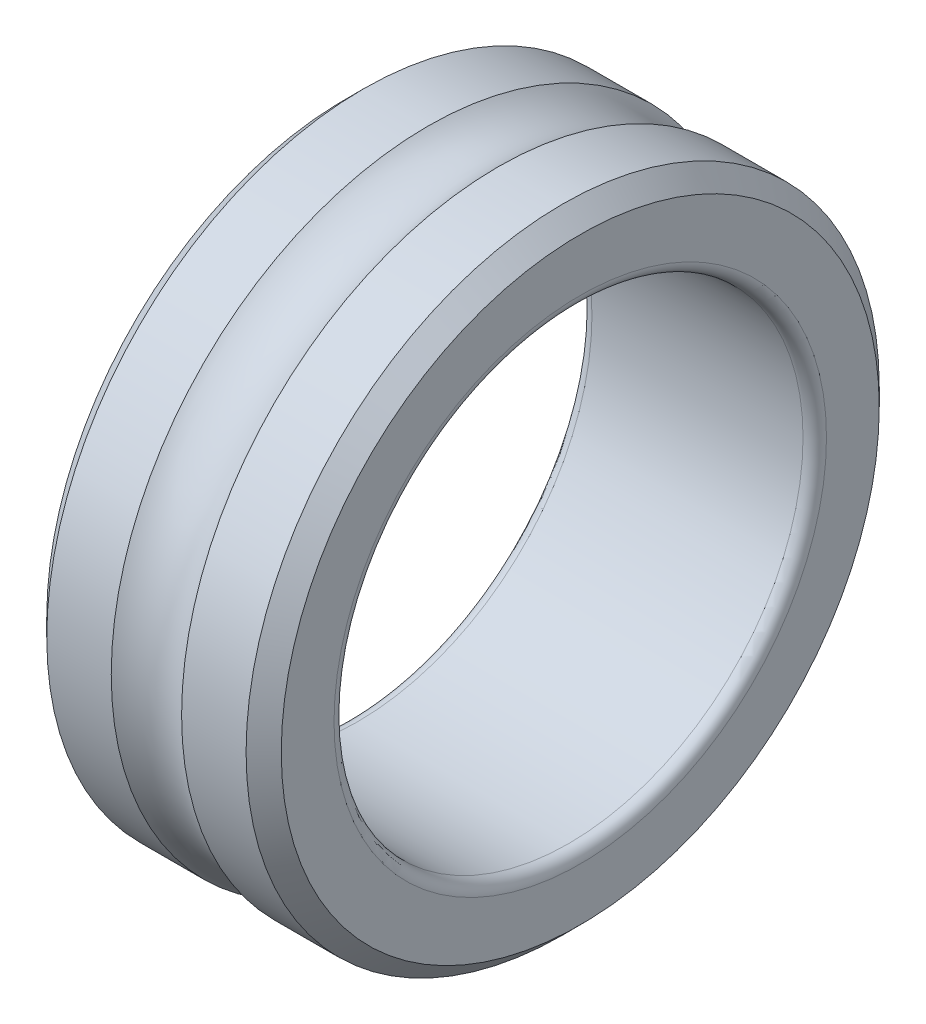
ISO-10303-21;
HEADER;
FILE_DESCRIPTION(('STEP AP214'),'2;1');
FILE_NAME('part.step','',(''),(''),'','','');
FILE_SCHEMA(('AUTOMOTIVE_DESIGN { 1 0 10303 214 1 1 1 1 }'));
ENDSEC;
DATA;
#1=APPLICATION_CONTEXT('core data for automotive mechanical design processes');
#2=APPLICATION_PROTOCOL_DEFINITION('international standard','automotive_design',2000,#1);
#3=PRODUCT_CONTEXT('',#1,'mechanical');
#4=PRODUCT('Part','Part','',(#3));
#5=PRODUCT_RELATED_PRODUCT_CATEGORY('part','',(#4));
#6=PRODUCT_DEFINITION_FORMATION('','',#4);
#7=PRODUCT_DEFINITION_CONTEXT('part definition',#1,'design');
#8=PRODUCT_DEFINITION('design','',#6,#7);
#9=PRODUCT_DEFINITION_SHAPE('','',#8);
#10=(LENGTH_UNIT() NAMED_UNIT(*) SI_UNIT(.MILLI.,.METRE.));
#11=(NAMED_UNIT(*) PLANE_ANGLE_UNIT() SI_UNIT($,.RADIAN.));
#12=(NAMED_UNIT(*) SI_UNIT($,.STERADIAN.) SOLID_ANGLE_UNIT());
#13=UNCERTAINTY_MEASURE_WITH_UNIT(LENGTH_MEASURE(1.E-05),#10,'distance_accuracy_value','');
#14=(GEOMETRIC_REPRESENTATION_CONTEXT(3) GLOBAL_UNCERTAINTY_ASSIGNED_CONTEXT((#13)) GLOBAL_UNIT_ASSIGNED_CONTEXT((#10,
#11,#12)) REPRESENTATION_CONTEXT('',''));
#15=CARTESIAN_POINT('',(0.,0.,0.));
#16=DIRECTION('',(0.,0.,1.));
#17=DIRECTION('',(1.,0.,0.));
#18=AXIS2_PLACEMENT_3D('',#15,#16,#17);
#19=CARTESIAN_POINT('',(-4.5,0.,0.));
#20=DIRECTION('',(-1.,0.,0.));
#21=DIRECTION('',(0.,0.,1.));
#22=AXIS2_PLACEMENT_3D('',#19,#20,#21);
#23=TOROIDAL_SURFACE('',#22,10.5,0.5);
#24=CARTESIAN_POINT('',(-4.5,0.,0.));
#25=DIRECTION('',(-1.,0.,0.));
#26=DIRECTION('',(0.,0.,1.));
#27=AXIS2_PLACEMENT_3D('',#24,#25,#26);
#28=CIRCLE('',#27,10.);
#29=CARTESIAN_POINT('',(-4.5,0.,10.));
#30=VERTEX_POINT('',#29);
#31=EDGE_CURVE('E66',#30,#30,#28,.T.);
#32=ORIENTED_EDGE('',*,*,#31,.F.);
#33=EDGE_LOOP('',(#32));
#34=FACE_BOUND('',#33,.T.);
#35=CARTESIAN_POINT('',(-5.,0.,0.));
#36=DIRECTION('',(-1.,0.,0.));
#37=DIRECTION('',(0.,0.,1.));
#38=AXIS2_PLACEMENT_3D('',#35,#36,#37);
#39=CIRCLE('',#38,10.5);
#40=CARTESIAN_POINT('',(-5.,0.,10.5));
#41=VERTEX_POINT('',#40);
#42=EDGE_CURVE('E51',#41,#41,#39,.T.);
#43=ORIENTED_EDGE('',*,*,#42,.T.);
#44=EDGE_LOOP('',(#43));
#45=FACE_BOUND('',#44,.T.);
#46=ADVANCED_FACE('F32',(#34,#45),#23,.T.);
#47=CARTESIAN_POINT('',(-5.,10.5,0.));
#48=DIRECTION('',(1.,0.,0.));
#49=DIRECTION('',(0.,0.,-1.));
#50=AXIS2_PLACEMENT_3D('',#47,#48,#49);
#51=PLANE('',#50);
#52=CARTESIAN_POINT('',(-5.,0.,0.));
#53=DIRECTION('',(1.,0.,0.));
#54=DIRECTION('',(0.,0.,-1.));
#55=AXIS2_PLACEMENT_3D('',#52,#53,#54);
#56=CIRCLE('',#55,12.75);
#57=CARTESIAN_POINT('',(-5.,0.,-12.75));
#58=VERTEX_POINT('',#57);
#59=EDGE_CURVE('E38',#58,#58,#56,.F.);
#60=ORIENTED_EDGE('',*,*,#59,.T.);
#61=EDGE_LOOP('',(#60));
#62=FACE_BOUND('',#61,.T.);
#63=ORIENTED_EDGE('',*,*,#42,.F.);
#64=EDGE_LOOP('',(#63));
#65=FACE_BOUND('',#64,.T.);
#66=ADVANCED_FACE('F74',(#62,#65),#51,.F.);
#67=CARTESIAN_POINT('',(-6.83354681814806,0.,0.));
#68=DIRECTION('',(-1.,0.,0.));
#69=DIRECTION('',(0.,0.,1.));
#70=AXIS2_PLACEMENT_3D('',#67,#68,#69);
#71=CYLINDRICAL_SURFACE('',#70,13.5);
#72=CARTESIAN_POINT('',(-4.25,0.,0.));
#73=DIRECTION('',(1.,0.,0.));
#74=DIRECTION('',(0.,0.,-1.));
#75=AXIS2_PLACEMENT_3D('',#72,#73,#74);
#76=CIRCLE('',#75,13.5);
#77=CARTESIAN_POINT('',(-4.25,0.,-13.5));
#78=VERTEX_POINT('',#77);
#79=EDGE_CURVE('E10',#78,#78,#76,.T.);
#80=ORIENTED_EDGE('',*,*,#79,.T.);
#81=EDGE_LOOP('',(#80));
#82=FACE_BOUND('',#81,.T.);
#83=CARTESIAN_POINT('',(-1.49999999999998,0.,0.));
#84=DIRECTION('',(-1.,0.,0.));
#85=DIRECTION('',(0.,0.,1.));
#86=AXIS2_PLACEMENT_3D('',#83,#84,#85);
#87=CIRCLE('',#86,13.5);
#88=CARTESIAN_POINT('',(-1.49999999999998,0.,13.5));
#89=VERTEX_POINT('',#88);
#90=EDGE_CURVE('E54',#89,#89,#87,.T.);
#91=ORIENTED_EDGE('',*,*,#90,.T.);
#92=EDGE_LOOP('',(#91));
#93=FACE_BOUND('',#92,.T.);
#94=ADVANCED_FACE('F78',(#82,#93),#71,.T.);
#95=CARTESIAN_POINT('',(0.,0.,0.));
#96=DIRECTION('',(-1.,0.,0.));
#97=DIRECTION('',(0.,0.,1.));
#98=AXIS2_PLACEMENT_3D('',#95,#96,#97);
#99=TOROIDAL_SURFACE('',#98,15.5,2.5);
#100=ORIENTED_EDGE('',*,*,#90,.F.);
#101=EDGE_LOOP('',(#100));
#102=FACE_BOUND('',#101,.T.);
#103=CARTESIAN_POINT('',(1.49999999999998,0.,0.));
#104=DIRECTION('',(-1.,0.,0.));
#105=DIRECTION('',(0.,0.,1.));
#106=AXIS2_PLACEMENT_3D('',#103,#104,#105);
#107=CIRCLE('',#106,13.5);
#108=CARTESIAN_POINT('',(1.49999999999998,0.,13.5));
#109=VERTEX_POINT('',#108);
#110=EDGE_CURVE('E57',#109,#109,#107,.T.);
#111=ORIENTED_EDGE('',*,*,#110,.T.);
#112=EDGE_LOOP('',(#111));
#113=FACE_BOUND('',#112,.T.);
#114=ADVANCED_FACE('F82',(#102,#113),#99,.F.);
#115=CARTESIAN_POINT('',(-6.83354681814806,0.,0.));
#116=DIRECTION('',(-1.,0.,0.));
#117=DIRECTION('',(0.,0.,1.));
#118=AXIS2_PLACEMENT_3D('',#115,#116,#117);
#119=CYLINDRICAL_SURFACE('',#118,13.5);
#120=CARTESIAN_POINT('',(4.24999999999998,0.,0.));
#121=DIRECTION('',(-1.,0.,0.));
#122=DIRECTION('',(0.,0.,1.));
#123=AXIS2_PLACEMENT_3D('',#120,#121,#122);
#124=CIRCLE('',#123,13.5);
#125=CARTESIAN_POINT('',(4.24999999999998,0.,13.5));
#126=VERTEX_POINT('',#125);
#127=EDGE_CURVE('E46',#126,#126,#124,.T.);
#128=ORIENTED_EDGE('',*,*,#127,.T.);
#129=EDGE_LOOP('',(#128));
#130=FACE_BOUND('',#129,.T.);
#131=ORIENTED_EDGE('',*,*,#110,.F.);
#132=EDGE_LOOP('',(#131));
#133=FACE_BOUND('',#132,.T.);
#134=ADVANCED_FACE('F87',(#130,#133),#119,.T.);
#135=CARTESIAN_POINT('',(5.,10.5,0.));
#136=DIRECTION('',(-1.,0.,0.));
#137=DIRECTION('',(0.,0.,1.));
#138=AXIS2_PLACEMENT_3D('',#135,#136,#137);
#139=PLANE('',#138);
#140=CARTESIAN_POINT('',(5.,0.,0.));
#141=DIRECTION('',(-1.,0.,0.));
#142=DIRECTION('',(0.,0.,1.));
#143=AXIS2_PLACEMENT_3D('',#140,#141,#142);
#144=CIRCLE('',#143,12.75);
#145=CARTESIAN_POINT('',(5.,0.,12.75));
#146=VERTEX_POINT('',#145);
#147=EDGE_CURVE('E42',#146,#146,#144,.F.);
#148=ORIENTED_EDGE('',*,*,#147,.T.);
#149=EDGE_LOOP('',(#148));
#150=FACE_BOUND('',#149,.T.);
#151=CARTESIAN_POINT('',(5.,0.,0.));
#152=DIRECTION('',(-1.,0.,0.));
#153=DIRECTION('',(0.,0.,1.));
#154=AXIS2_PLACEMENT_3D('',#151,#152,#153);
#155=CIRCLE('',#154,10.5);
#156=CARTESIAN_POINT('',(5.,0.,10.5));
#157=VERTEX_POINT('',#156);
#158=EDGE_CURVE('E60',#157,#157,#155,.T.);
#159=ORIENTED_EDGE('',*,*,#158,.T.);
#160=EDGE_LOOP('',(#159));
#161=FACE_BOUND('',#160,.T.);
#162=ADVANCED_FACE('F91',(#150,#161),#139,.F.);
#163=CARTESIAN_POINT('',(4.5,0.,0.));
#164=DIRECTION('',(-1.,0.,0.));
#165=DIRECTION('',(0.,0.,1.));
#166=AXIS2_PLACEMENT_3D('',#163,#164,#165);
#167=TOROIDAL_SURFACE('',#166,10.5,0.5);
#168=ORIENTED_EDGE('',*,*,#158,.F.);
#169=EDGE_LOOP('',(#168));
#170=FACE_BOUND('',#169,.T.);
#171=CARTESIAN_POINT('',(4.5,0.,0.));
#172=DIRECTION('',(-1.,0.,0.));
#173=DIRECTION('',(0.,0.,1.));
#174=AXIS2_PLACEMENT_3D('',#171,#172,#173);
#175=CIRCLE('',#174,10.);
#176=CARTESIAN_POINT('',(4.5,0.,10.));
#177=VERTEX_POINT('',#176);
#178=EDGE_CURVE('E63',#177,#177,#175,.T.);
#179=ORIENTED_EDGE('',*,*,#178,.T.);
#180=EDGE_LOOP('',(#179));
#181=FACE_BOUND('',#180,.T.);
#182=ADVANCED_FACE('F95',(#170,#181),#167,.T.);
#183=CARTESIAN_POINT('',(-6.83354681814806,0.,0.));
#184=DIRECTION('',(-1.,0.,0.));
#185=DIRECTION('',(0.,0.,1.));
#186=AXIS2_PLACEMENT_3D('',#183,#184,#185);
#187=CYLINDRICAL_SURFACE('',#186,10.);
#188=ORIENTED_EDGE('',*,*,#178,.F.);
#189=EDGE_LOOP('',(#188));
#190=FACE_BOUND('',#189,.T.);
#191=ORIENTED_EDGE('',*,*,#31,.T.);
#192=EDGE_LOOP('',(#191));
#193=FACE_BOUND('',#192,.T.);
#194=ADVANCED_FACE('F70',(#190,#193),#187,.F.);
#195=CARTESIAN_POINT('',(4.24999999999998,0.,0.));
#196=DIRECTION('',(-1.,0.,0.));
#197=DIRECTION('',(0.,0.,1.));
#198=AXIS2_PLACEMENT_3D('',#195,#196,#197);
#199=CONICAL_SURFACE('',#198,13.5,0.785398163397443);
#200=ORIENTED_EDGE('',*,*,#147,.F.);
#201=EDGE_LOOP('',(#200));
#202=FACE_BOUND('',#201,.T.);
#203=ORIENTED_EDGE('',*,*,#127,.F.);
#204=EDGE_LOOP('',(#203));
#205=FACE_BOUND('',#204,.T.);
#206=ADVANCED_FACE('F102',(#202,#205),#199,.T.);
#207=CARTESIAN_POINT('',(-5.,0.,0.));
#208=DIRECTION('',(1.,0.,0.));
#209=DIRECTION('',(0.,0.,-1.));
#210=AXIS2_PLACEMENT_3D('',#207,#208,#209);
#211=CONICAL_SURFACE('',#210,12.75,0.785398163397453);
#212=ORIENTED_EDGE('',*,*,#79,.F.);
#213=EDGE_LOOP('',(#212));
#214=FACE_BOUND('',#213,.T.);
#215=ORIENTED_EDGE('',*,*,#59,.F.);
#216=EDGE_LOOP('',(#215));
#217=FACE_BOUND('',#216,.T.);
#218=ADVANCED_FACE('F106',(#214,#217),#211,.T.);
#219=CLOSED_SHELL('',(#46,#66,#94,#114,#134,#162,#182,#194,#206,#218));
#220=MANIFOLD_SOLID_BREP('B2',#219);
#221=ADVANCED_BREP_SHAPE_REPRESENTATION('',(#18,#220),#14);
#222=SHAPE_DEFINITION_REPRESENTATION(#9,#221);
ENDSEC;
END-ISO-10303-21;
